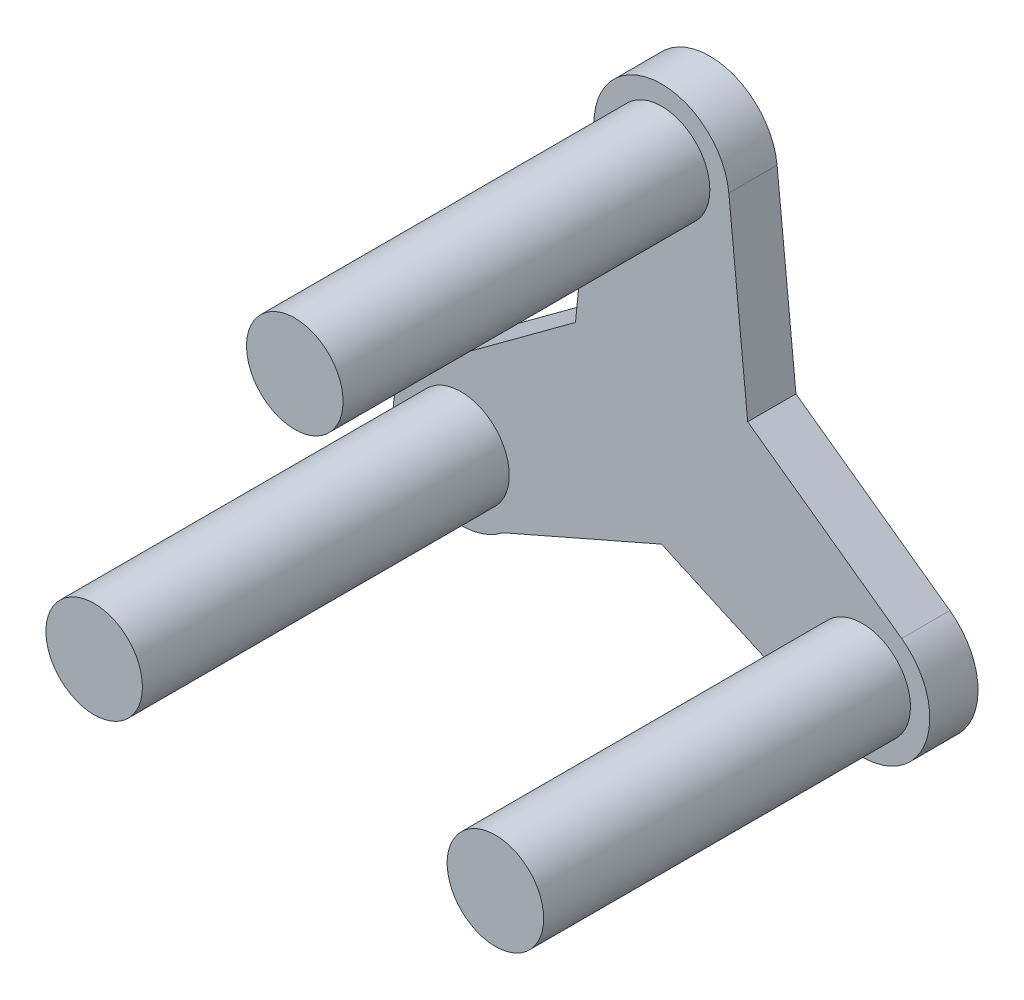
ISO-10303-21;
HEADER;
FILE_DESCRIPTION(('STEP AP214'),'2;1');
FILE_NAME('part.step','',(''),(''),'','','');
FILE_SCHEMA(('AUTOMOTIVE_DESIGN { 1 0 10303 214 1 1 1 1 }'));
ENDSEC;
DATA;
#1=APPLICATION_CONTEXT('core data for automotive mechanical design processes');
#2=APPLICATION_PROTOCOL_DEFINITION('international standard','automotive_design',2000,#1);
#3=PRODUCT_CONTEXT('',#1,'mechanical');
#4=PRODUCT('Part','Part','',(#3));
#5=PRODUCT_RELATED_PRODUCT_CATEGORY('part','',(#4));
#6=PRODUCT_DEFINITION_FORMATION('','',#4);
#7=PRODUCT_DEFINITION_CONTEXT('part definition',#1,'design');
#8=PRODUCT_DEFINITION('design','',#6,#7);
#9=PRODUCT_DEFINITION_SHAPE('','',#8);
#10=(LENGTH_UNIT() NAMED_UNIT(*) SI_UNIT(.MILLI.,.METRE.));
#11=(NAMED_UNIT(*) PLANE_ANGLE_UNIT() SI_UNIT($,.RADIAN.));
#12=(NAMED_UNIT(*) SI_UNIT($,.STERADIAN.) SOLID_ANGLE_UNIT());
#13=UNCERTAINTY_MEASURE_WITH_UNIT(LENGTH_MEASURE(1.E-05),#10,'distance_accuracy_value','');
#14=(GEOMETRIC_REPRESENTATION_CONTEXT(3) GLOBAL_UNCERTAINTY_ASSIGNED_CONTEXT((#13)) GLOBAL_UNIT_ASSIGNED_CONTEXT((#10,
#11,#12)) REPRESENTATION_CONTEXT('',''));
#15=CARTESIAN_POINT('',(0.,0.,0.));
#16=DIRECTION('',(0.,0.,1.));
#17=DIRECTION('',(1.,0.,0.));
#18=AXIS2_PLACEMENT_3D('',#15,#16,#17);
#19=CARTESIAN_POINT('',(1.89026991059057,-4.31806241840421,2.5));
#20=DIRECTION('',(0.401017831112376,-0.91607024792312,0.));
#21=DIRECTION('',(0.91607024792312,0.401017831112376,0.));
#22=AXIS2_PLACEMENT_3D('',#19,#20,#21);
#23=PLANE('',#22);
#24=DIRECTION('',(-0.91607024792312,-0.401017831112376,0.));
#25=VECTOR('',#24,1.);
#26=CARTESIAN_POINT('',(1.89026991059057,-4.31806241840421,0.));
#27=LINE('',#26,#25);
#28=CARTESIAN_POINT('',(-0.00549674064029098,-5.14795099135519,0.));
#29=VERTEX_POINT('',#28);
#30=CARTESIAN_POINT('',(-8.21897999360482,-8.74347573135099,0.));
#31=VERTEX_POINT('',#30);
#32=EDGE_CURVE('E143',#29,#31,#27,.T.);
#33=ORIENTED_EDGE('',*,*,#32,.F.);
#34=DIRECTION('',(0.,0.,-1.));
#35=VECTOR('',#34,1.);
#36=CARTESIAN_POINT('',(-0.00549674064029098,-5.14795099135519,2.5));
#37=LINE('',#36,#35);
#38=CARTESIAN_POINT('',(-0.00549674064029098,-5.14795099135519,2.5));
#39=VERTEX_POINT('',#38);
#40=EDGE_CURVE('E11',#39,#29,#37,.T.);
#41=ORIENTED_EDGE('',*,*,#40,.F.);
#42=DIRECTION('',(-0.91607024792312,-0.401017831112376,0.));
#43=VECTOR('',#42,1.);
#44=CARTESIAN_POINT('',(1.89026991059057,-4.31806241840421,2.5));
#45=LINE('',#44,#43);
#46=CARTESIAN_POINT('',(-8.21897999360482,-8.74347573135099,2.5));
#47=VERTEX_POINT('',#46);
#48=EDGE_CURVE('E164',#39,#47,#45,.T.);
#49=ORIENTED_EDGE('',*,*,#48,.T.);
#50=DIRECTION('',(0.,0.,-1.));
#51=VECTOR('',#50,1.);
#52=CARTESIAN_POINT('',(-8.21897999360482,-8.74347573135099,2.5));
#53=LINE('',#52,#51);
#54=EDGE_CURVE('E96',#47,#31,#53,.T.);
#55=ORIENTED_EDGE('',*,*,#54,.T.);
#56=EDGE_LOOP('',(#33,#41,#49,#55));
#57=FACE_BOUND('',#56,.T.);
#58=ADVANCED_FACE('F43',(#57),#23,.T.);
#59=CARTESIAN_POINT('',(-1.93090584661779,-4.27913418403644,2.5));
#60=DIRECTION('',(0.411302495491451,0.911498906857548,0.));
#61=DIRECTION('',(-0.911498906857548,0.411302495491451,0.));
#62=AXIS2_PLACEMENT_3D('',#59,#60,#61);
#63=PLANE('',#62);
#64=DIRECTION('',(0.911498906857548,-0.411302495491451,0.));
#65=VECTOR('',#64,1.);
#66=CARTESIAN_POINT('',(-1.93090584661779,-4.27913418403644,0.));
#67=LINE('',#66,#65);
#68=CARTESIAN_POINT('',(8.95274611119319,-9.19024617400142,0.));
#69=VERTEX_POINT('',#68);
#70=EDGE_CURVE('E146',#29,#69,#67,.T.);
#71=ORIENTED_EDGE('',*,*,#70,.T.);
#72=DIRECTION('',(0.,0.,-1.));
#73=VECTOR('',#72,1.);
#74=CARTESIAN_POINT('',(8.95274611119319,-9.19024617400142,2.5));
#75=LINE('',#74,#73);
#76=CARTESIAN_POINT('',(8.95274611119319,-9.19024617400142,2.5));
#77=VERTEX_POINT('',#76);
#78=EDGE_CURVE('E51',#77,#69,#75,.T.);
#79=ORIENTED_EDGE('',*,*,#78,.F.);
#80=DIRECTION('',(0.911498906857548,-0.411302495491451,0.));
#81=VECTOR('',#80,1.);
#82=CARTESIAN_POINT('',(-1.93090584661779,-4.27913418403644,2.5));
#83=LINE('',#82,#81);
#84=EDGE_CURVE('E196',#39,#77,#83,.T.);
#85=ORIENTED_EDGE('',*,*,#84,.F.);
#86=ORIENTED_EDGE('',*,*,#40,.T.);
#87=EDGE_LOOP('',(#71,#79,#85,#86));
#88=FACE_BOUND('',#87,.T.);
#89=ADVANCED_FACE('F252',(#88),#63,.F.);
#90=CARTESIAN_POINT('',(10.3923048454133,-6.,2.5));
#91=DIRECTION('',(0.,0.,-1.));
#92=DIRECTION('',(-1.,0.,0.));
#93=AXIS2_PLACEMENT_3D('',#90,#91,#92);
#94=CYLINDRICAL_SURFACE('',#93,3.5);
#95=CARTESIAN_POINT('',(10.3923048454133,-6.,0.));
#96=DIRECTION('',(0.,0.,1.));
#97=DIRECTION('',(1.,0.,0.));
#98=AXIS2_PLACEMENT_3D('',#95,#96,#97);
#99=CIRCLE('',#98,3.5);
#100=CARTESIAN_POINT('',(12.4353597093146,-3.15818247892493,0.));
#101=VERTEX_POINT('',#100);
#102=EDGE_CURVE('E149',#69,#101,#99,.T.);
#103=ORIENTED_EDGE('',*,*,#102,.T.);
#104=DIRECTION('',(0.,0.,-1.));
#105=VECTOR('',#104,1.);
#106=CARTESIAN_POINT('',(12.4353597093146,-3.15818247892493,2.5));
#107=LINE('',#106,#105);
#108=CARTESIAN_POINT('',(12.4353597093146,-3.15818247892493,2.5));
#109=VERTEX_POINT('',#108);
#110=EDGE_CURVE('E173',#109,#101,#107,.T.);
#111=ORIENTED_EDGE('',*,*,#110,.F.);
#112=CARTESIAN_POINT('',(10.3923048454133,-6.,2.5));
#113=DIRECTION('',(0.,0.,1.));
#114=DIRECTION('',(1.,0.,0.));
#115=AXIS2_PLACEMENT_3D('',#112,#113,#114);
#116=CIRCLE('',#115,3.5);
#117=EDGE_CURVE('E181',#77,#109,#116,.T.);
#118=ORIENTED_EDGE('',*,*,#117,.F.);
#119=ORIENTED_EDGE('',*,*,#78,.T.);
#120=EDGE_LOOP('',(#103,#111,#118,#119));
#121=FACE_BOUND('',#120,.T.);
#122=ADVANCED_FACE('F179',(#121),#94,.T.);
#123=CARTESIAN_POINT('',(2.74038598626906,3.81178060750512,2.5));
#124=DIRECTION('',(0.583729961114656,0.811947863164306,0.));
#125=DIRECTION('',(-0.811947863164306,0.583729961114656,0.));
#126=AXIS2_PLACEMENT_3D('',#123,#124,#125);
#127=PLANE('',#126);
#128=DIRECTION('',(0.811947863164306,-0.583729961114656,0.));
#129=VECTOR('',#128,1.);
#130=CARTESIAN_POINT('',(2.74038598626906,3.81178060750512,0.));
#131=LINE('',#130,#129);
#132=CARTESIAN_POINT('',(4.46040436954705,2.57521566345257,0.));
#133=VERTEX_POINT('',#132);
#134=EDGE_CURVE('E152',#133,#101,#131,.T.);
#135=ORIENTED_EDGE('',*,*,#134,.F.);
#136=DIRECTION('',(0.,0.,-1.));
#137=VECTOR('',#136,1.);
#138=CARTESIAN_POINT('',(4.46040436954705,2.57521566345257,2.5));
#139=LINE('',#138,#137);
#140=CARTESIAN_POINT('',(4.46040436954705,2.57521566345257,2.5));
#141=VERTEX_POINT('',#140);
#142=EDGE_CURVE('E171',#141,#133,#139,.T.);
#143=ORIENTED_EDGE('',*,*,#142,.F.);
#144=DIRECTION('',(0.811947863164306,-0.583729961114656,0.));
#145=VECTOR('',#144,1.);
#146=CARTESIAN_POINT('',(2.74038598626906,3.81178060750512,2.5));
#147=LINE('',#146,#145);
#148=EDGE_CURVE('E194',#141,#109,#147,.T.);
#149=ORIENTED_EDGE('',*,*,#148,.T.);
#150=ORIENTED_EDGE('',*,*,#110,.T.);
#151=EDGE_LOOP('',(#135,#143,#149,#150));
#152=FACE_BOUND('',#151,.T.);
#153=ADVANCED_FACE('F190',(#152),#127,.T.);
#154=CARTESIAN_POINT('',(4.67129183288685,0.467353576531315,2.5));
#155=DIRECTION('',(-0.995032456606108,-0.0995510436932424,0.));
#156=DIRECTION('',(0.0995510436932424,-0.995032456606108,0.));
#157=AXIS2_PLACEMENT_3D('',#154,#155,#156);
#158=PLANE('',#157);
#159=DIRECTION('',(-0.0995510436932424,0.995032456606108,0.));
#160=VECTOR('',#159,1.);
#161=CARTESIAN_POINT('',(4.67129183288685,0.467353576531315,0.));
#162=LINE('',#161,#160);
#163=CARTESIAN_POINT('',(3.48261359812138,12.3484286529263,0.));
#164=VERTEX_POINT('',#163);
#165=EDGE_CURVE('E155',#133,#164,#162,.T.);
#166=ORIENTED_EDGE('',*,*,#165,.T.);
#167=DIRECTION('',(0.,0.,-1.));
#168=VECTOR('',#167,1.);
#169=CARTESIAN_POINT('',(3.48261359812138,12.3484286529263,2.5));
#170=LINE('',#169,#168);
#171=CARTESIAN_POINT('',(3.48261359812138,12.3484286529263,2.5));
#172=VERTEX_POINT('',#171);
#173=EDGE_CURVE('E168',#172,#164,#170,.T.);
#174=ORIENTED_EDGE('',*,*,#173,.F.);
#175=DIRECTION('',(-0.0995510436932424,0.995032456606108,0.));
#176=VECTOR('',#175,1.);
#177=CARTESIAN_POINT('',(4.67129183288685,0.467353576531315,2.5));
#178=LINE('',#177,#176);
#179=EDGE_CURVE('E138',#141,#172,#178,.T.);
#180=ORIENTED_EDGE('',*,*,#179,.F.);
#181=ORIENTED_EDGE('',*,*,#142,.T.);
#182=EDGE_LOOP('',(#166,#174,#180,#181));
#183=FACE_BOUND('',#182,.T.);
#184=ADVANCED_FACE('F270',(#183),#158,.F.);
#185=CARTESIAN_POINT('',(0.,12.,2.5));
#186=DIRECTION('',(0.,0.,-1.));
#187=DIRECTION('',(-1.,0.,0.));
#188=AXIS2_PLACEMENT_3D('',#185,#186,#187);
#189=CYLINDRICAL_SURFACE('',#188,3.5);
#190=CARTESIAN_POINT('',(0.,12.,0.));
#191=DIRECTION('',(0.,0.,1.));
#192=DIRECTION('',(1.,0.,0.));
#193=AXIS2_PLACEMENT_3D('',#190,#191,#192);
#194=CIRCLE('',#193,3.5);
#195=CARTESIAN_POINT('',(-3.48261359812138,12.3484286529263,0.));
#196=VERTEX_POINT('',#195);
#197=EDGE_CURVE('E157',#164,#196,#194,.T.);
#198=ORIENTED_EDGE('',*,*,#197,.T.);
#199=DIRECTION('',(0.,0.,-1.));
#200=VECTOR('',#199,1.);
#201=CARTESIAN_POINT('',(-3.48261359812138,12.3484286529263,2.5));
#202=LINE('',#201,#200);
#203=CARTESIAN_POINT('',(-3.48261359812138,12.3484286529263,2.5));
#204=VERTEX_POINT('',#203);
#205=EDGE_CURVE('E127',#204,#196,#202,.T.);
#206=ORIENTED_EDGE('',*,*,#205,.F.);
#207=CARTESIAN_POINT('',(0.,12.,2.5));
#208=DIRECTION('',(0.,0.,1.));
#209=DIRECTION('',(1.,0.,0.));
#210=AXIS2_PLACEMENT_3D('',#207,#208,#209);
#211=CIRCLE('',#210,3.5);
#212=EDGE_CURVE('E135',#172,#204,#211,.T.);
#213=ORIENTED_EDGE('',*,*,#212,.F.);
#214=ORIENTED_EDGE('',*,*,#173,.T.);
#215=EDGE_LOOP('',(#198,#206,#213,#214));
#216=FACE_BOUND('',#215,.T.);
#217=ADVANCED_FACE('F267',(#216),#189,.T.);
#218=CARTESIAN_POINT('',(-4.67129183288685,0.467353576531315,2.5));
#219=DIRECTION('',(-0.995032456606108,0.0995510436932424,0.));
#220=DIRECTION('',(-0.0995510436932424,-0.995032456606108,0.));
#221=AXIS2_PLACEMENT_3D('',#218,#219,#220);
#222=PLANE('',#221);
#223=DIRECTION('',(0.0995510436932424,0.995032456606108,0.));
#224=VECTOR('',#223,1.);
#225=CARTESIAN_POINT('',(-4.67129183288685,0.467353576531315,0.));
#226=LINE('',#225,#224);
#227=CARTESIAN_POINT('',(-4.46100470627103,2.56921517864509,0.));
#228=VERTEX_POINT('',#227);
#229=EDGE_CURVE('E126',#228,#196,#226,.T.);
#230=ORIENTED_EDGE('',*,*,#229,.F.);
#231=DIRECTION('',(0.,0.,-1.));
#232=VECTOR('',#231,1.);
#233=CARTESIAN_POINT('',(-4.46100470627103,2.56921517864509,2.5));
#234=LINE('',#233,#232);
#235=CARTESIAN_POINT('',(-4.46100470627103,2.56921517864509,2.5));
#236=VERTEX_POINT('',#235);
#237=EDGE_CURVE('E120',#236,#228,#234,.T.);
#238=ORIENTED_EDGE('',*,*,#237,.F.);
#239=DIRECTION('',(0.0995510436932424,0.995032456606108,0.));
#240=VECTOR('',#239,1.);
#241=CARTESIAN_POINT('',(-4.67129183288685,0.467353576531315,2.5));
#242=LINE('',#241,#240);
#243=EDGE_CURVE('E124',#236,#204,#242,.T.);
#244=ORIENTED_EDGE('',*,*,#243,.T.);
#245=ORIENTED_EDGE('',*,*,#205,.T.);
#246=EDGE_LOOP('',(#230,#238,#244,#245));
#247=FACE_BOUND('',#246,.T.);
#248=ADVANCED_FACE('F122',(#247),#222,.T.);
#249=CARTESIAN_POINT('',(-2.79441679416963,3.79605297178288,2.5));
#250=DIRECTION('',(0.592831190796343,-0.805326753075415,0.));
#251=DIRECTION('',(0.805326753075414,0.592831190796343,0.));
#252=AXIS2_PLACEMENT_3D('',#249,#250,#251);
#253=PLANE('',#252);
#254=DIRECTION('',(-0.805326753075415,-0.592831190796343,0.));
#255=VECTOR('',#254,1.);
#256=CARTESIAN_POINT('',(-2.79441679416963,3.79605297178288,0.));
#257=LINE('',#256,#255);
#258=CARTESIAN_POINT('',(-11.6815620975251,-2.74610760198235,0.));
#259=VERTEX_POINT('',#258);
#260=EDGE_CURVE('E89',#228,#259,#257,.T.);
#261=ORIENTED_EDGE('',*,*,#260,.T.);
#262=DIRECTION('',(0.,0.,-1.));
#263=VECTOR('',#262,1.);
#264=CARTESIAN_POINT('',(-11.6815620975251,-2.74610760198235,2.5));
#265=LINE('',#264,#263);
#266=CARTESIAN_POINT('',(-11.6815620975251,-2.74610760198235,2.5));
#267=VERTEX_POINT('',#266);
#268=EDGE_CURVE('E128',#267,#259,#265,.T.);
#269=ORIENTED_EDGE('',*,*,#268,.F.);
#270=DIRECTION('',(-0.805326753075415,-0.592831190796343,0.));
#271=VECTOR('',#270,1.);
#272=CARTESIAN_POINT('',(-2.79441679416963,3.79605297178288,2.5));
#273=LINE('',#272,#271);
#274=EDGE_CURVE('E130',#236,#267,#273,.T.);
#275=ORIENTED_EDGE('',*,*,#274,.F.);
#276=ORIENTED_EDGE('',*,*,#237,.T.);
#277=EDGE_LOOP('',(#261,#269,#275,#276));
#278=FACE_BOUND('',#277,.T.);
#279=ADVANCED_FACE('F131',(#278),#253,.F.);
#280=CARTESIAN_POINT('',(-10.3923048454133,-6.00000000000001,2.5));
#281=DIRECTION('',(0.,0.,-1.));
#282=DIRECTION('',(-1.,0.,0.));
#283=AXIS2_PLACEMENT_3D('',#280,#281,#282);
#284=CYLINDRICAL_SURFACE('',#283,3.5);
#285=CARTESIAN_POINT('',(-10.3923048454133,-6.00000000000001,0.));
#286=DIRECTION('',(0.,0.,1.));
#287=DIRECTION('',(1.,0.,0.));
#288=AXIS2_PLACEMENT_3D('',#285,#286,#287);
#289=CIRCLE('',#288,3.5);
#290=EDGE_CURVE('E162',#259,#31,#289,.T.);
#291=ORIENTED_EDGE('',*,*,#290,.T.);
#292=ORIENTED_EDGE('',*,*,#54,.F.);
#293=CARTESIAN_POINT('',(-10.3923048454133,-6.00000000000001,2.5));
#294=DIRECTION('',(0.,0.,1.));
#295=DIRECTION('',(1.,0.,0.));
#296=AXIS2_PLACEMENT_3D('',#293,#294,#295);
#297=CIRCLE('',#296,3.5);
#298=EDGE_CURVE('E59',#267,#47,#297,.T.);
#299=ORIENTED_EDGE('',*,*,#298,.F.);
#300=ORIENTED_EDGE('',*,*,#268,.T.);
#301=EDGE_LOOP('',(#291,#292,#299,#300));
#302=FACE_BOUND('',#301,.T.);
#303=ADVANCED_FACE('F230',(#302),#284,.T.);
#304=CARTESIAN_POINT('',(0.,0.,2.5));
#305=DIRECTION('',(0.,0.,1.));
#306=DIRECTION('',(1.,0.,0.));
#307=AXIS2_PLACEMENT_3D('',#304,#305,#306);
#308=PLANE('',#307);
#309=CARTESIAN_POINT('',(0.,12.,2.5));
#310=DIRECTION('',(0.,0.,1.));
#311=DIRECTION('',(1.,0.,0.));
#312=AXIS2_PLACEMENT_3D('',#309,#310,#311);
#313=CIRCLE('',#312,2.5);
#314=CARTESIAN_POINT('',(2.5,12.,2.5));
#315=VERTEX_POINT('',#314);
#316=EDGE_CURVE('E213',#315,#315,#313,.T.);
#317=ORIENTED_EDGE('',*,*,#316,.F.);
#318=EDGE_LOOP('',(#317));
#319=FACE_BOUND('',#318,.T.);
#320=CARTESIAN_POINT('',(10.3923048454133,-6.,2.5));
#321=DIRECTION('',(0.,0.,1.));
#322=DIRECTION('',(1.,0.,0.));
#323=AXIS2_PLACEMENT_3D('',#320,#321,#322);
#324=CIRCLE('',#323,2.5);
#325=CARTESIAN_POINT('',(12.8923048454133,-6.,2.5));
#326=VERTEX_POINT('',#325);
#327=EDGE_CURVE('E210',#326,#326,#324,.T.);
#328=ORIENTED_EDGE('',*,*,#327,.F.);
#329=EDGE_LOOP('',(#328));
#330=FACE_BOUND('',#329,.T.);
#331=CARTESIAN_POINT('',(-10.3923048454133,-6.,2.5));
#332=DIRECTION('',(0.,0.,1.));
#333=DIRECTION('',(1.,0.,0.));
#334=AXIS2_PLACEMENT_3D('',#331,#332,#333);
#335=CIRCLE('',#334,2.5);
#336=CARTESIAN_POINT('',(-7.89230484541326,-6.,2.5));
#337=VERTEX_POINT('',#336);
#338=EDGE_CURVE('E204',#337,#337,#335,.T.);
#339=ORIENTED_EDGE('',*,*,#338,.F.);
#340=EDGE_LOOP('',(#339));
#341=FACE_BOUND('',#340,.T.);
#342=ORIENTED_EDGE('',*,*,#48,.F.);
#343=ORIENTED_EDGE('',*,*,#84,.T.);
#344=ORIENTED_EDGE('',*,*,#117,.T.);
#345=ORIENTED_EDGE('',*,*,#148,.F.);
#346=ORIENTED_EDGE('',*,*,#179,.T.);
#347=ORIENTED_EDGE('',*,*,#212,.T.);
#348=ORIENTED_EDGE('',*,*,#243,.F.);
#349=ORIENTED_EDGE('',*,*,#274,.T.);
#350=ORIENTED_EDGE('',*,*,#298,.T.);
#351=EDGE_LOOP('',(#342,#343,#344,#345,#346,#347,#348,#349,#350));
#352=FACE_BOUND('',#351,.T.);
#353=ADVANCED_FACE('F133',(#319,#330,#341,#352),#308,.T.);
#354=CARTESIAN_POINT('',(0.,0.,0.));
#355=DIRECTION('',(0.,0.,1.));
#356=DIRECTION('',(1.,0.,0.));
#357=AXIS2_PLACEMENT_3D('',#354,#355,#356);
#358=PLANE('',#357);
#359=ORIENTED_EDGE('',*,*,#32,.T.);
#360=ORIENTED_EDGE('',*,*,#290,.F.);
#361=ORIENTED_EDGE('',*,*,#260,.F.);
#362=ORIENTED_EDGE('',*,*,#229,.T.);
#363=ORIENTED_EDGE('',*,*,#197,.F.);
#364=ORIENTED_EDGE('',*,*,#165,.F.);
#365=ORIENTED_EDGE('',*,*,#134,.T.);
#366=ORIENTED_EDGE('',*,*,#102,.F.);
#367=ORIENTED_EDGE('',*,*,#70,.F.);
#368=EDGE_LOOP('',(#359,#360,#361,#362,#363,#364,#365,#366,#367));
#369=FACE_BOUND('',#368,.T.);
#370=ADVANCED_FACE('F185',(#369),#358,.F.);
#371=CARTESIAN_POINT('',(-10.3923048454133,-6.,21.5));
#372=DIRECTION('',(0.,0.,-1.));
#373=DIRECTION('',(-1.,0.,0.));
#374=AXIS2_PLACEMENT_3D('',#371,#372,#373);
#375=CYLINDRICAL_SURFACE('',#374,2.5);
#376=CARTESIAN_POINT('',(-10.3923048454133,-6.,21.5));
#377=DIRECTION('',(0.,0.,1.));
#378=DIRECTION('',(1.,0.,0.));
#379=AXIS2_PLACEMENT_3D('',#376,#377,#378);
#380=CIRCLE('',#379,2.5);
#381=CARTESIAN_POINT('',(-7.89230484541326,-6.,21.5));
#382=VERTEX_POINT('',#381);
#383=EDGE_CURVE('E201',#382,#382,#380,.T.);
#384=ORIENTED_EDGE('',*,*,#383,.F.);
#385=EDGE_LOOP('',(#384));
#386=FACE_BOUND('',#385,.T.);
#387=ORIENTED_EDGE('',*,*,#338,.T.);
#388=EDGE_LOOP('',(#387));
#389=FACE_BOUND('',#388,.T.);
#390=ADVANCED_FACE('F236',(#386,#389),#375,.T.);
#391=CARTESIAN_POINT('',(-10.3923048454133,-6.,21.5));
#392=DIRECTION('',(0.,0.,1.));
#393=DIRECTION('',(1.,0.,0.));
#394=AXIS2_PLACEMENT_3D('',#391,#392,#393);
#395=PLANE('',#394);
#396=ORIENTED_EDGE('',*,*,#383,.T.);
#397=EDGE_LOOP('',(#396));
#398=FACE_BOUND('',#397,.T.);
#399=ADVANCED_FACE('F238',(#398),#395,.T.);
#400=CARTESIAN_POINT('',(10.3923048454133,-6.,21.5));
#401=DIRECTION('',(0.,0.,-1.));
#402=DIRECTION('',(-1.,0.,0.));
#403=AXIS2_PLACEMENT_3D('',#400,#401,#402);
#404=CYLINDRICAL_SURFACE('',#403,2.5);
#405=CARTESIAN_POINT('',(10.3923048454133,-6.,21.5));
#406=DIRECTION('',(0.,0.,1.));
#407=DIRECTION('',(1.,0.,0.));
#408=AXIS2_PLACEMENT_3D('',#405,#406,#407);
#409=CIRCLE('',#408,2.5);
#410=CARTESIAN_POINT('',(12.8923048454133,-6.,21.5));
#411=VERTEX_POINT('',#410);
#412=EDGE_CURVE('E207',#411,#411,#409,.T.);
#413=ORIENTED_EDGE('',*,*,#412,.F.);
#414=EDGE_LOOP('',(#413));
#415=FACE_BOUND('',#414,.T.);
#416=ORIENTED_EDGE('',*,*,#327,.T.);
#417=EDGE_LOOP('',(#416));
#418=FACE_BOUND('',#417,.T.);
#419=ADVANCED_FACE('F244',(#415,#418),#404,.T.);
#420=CARTESIAN_POINT('',(10.3923048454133,-6.,21.5));
#421=DIRECTION('',(0.,0.,1.));
#422=DIRECTION('',(1.,0.,0.));
#423=AXIS2_PLACEMENT_3D('',#420,#421,#422);
#424=PLANE('',#423);
#425=ORIENTED_EDGE('',*,*,#412,.T.);
#426=EDGE_LOOP('',(#425));
#427=FACE_BOUND('',#426,.T.);
#428=ADVANCED_FACE('F224',(#427),#424,.T.);
#429=CARTESIAN_POINT('',(0.,12.,21.5));
#430=DIRECTION('',(0.,0.,-1.));
#431=DIRECTION('',(-1.,0.,0.));
#432=AXIS2_PLACEMENT_3D('',#429,#430,#431);
#433=CYLINDRICAL_SURFACE('',#432,2.5);
#434=CARTESIAN_POINT('',(0.,12.,21.5));
#435=DIRECTION('',(0.,0.,1.));
#436=DIRECTION('',(1.,0.,0.));
#437=AXIS2_PLACEMENT_3D('',#434,#435,#436);
#438=CIRCLE('',#437,2.5);
#439=CARTESIAN_POINT('',(2.5,12.,21.5));
#440=VERTEX_POINT('',#439);
#441=EDGE_CURVE('E147',#440,#440,#438,.T.);
#442=ORIENTED_EDGE('',*,*,#441,.F.);
#443=EDGE_LOOP('',(#442));
#444=FACE_BOUND('',#443,.T.);
#445=ORIENTED_EDGE('',*,*,#316,.T.);
#446=EDGE_LOOP('',(#445));
#447=FACE_BOUND('',#446,.T.);
#448=ADVANCED_FACE('F221',(#444,#447),#433,.T.);
#449=CARTESIAN_POINT('',(0.,12.,21.5));
#450=DIRECTION('',(0.,0.,1.));
#451=DIRECTION('',(1.,0.,0.));
#452=AXIS2_PLACEMENT_3D('',#449,#450,#451);
#453=PLANE('',#452);
#454=ORIENTED_EDGE('',*,*,#441,.T.);
#455=EDGE_LOOP('',(#454));
#456=FACE_BOUND('',#455,.T.);
#457=ADVANCED_FACE('F219',(#456),#453,.T.);
#458=CLOSED_SHELL('',(#58,#89,#122,#153,#184,#217,#248,#279,#303,#353,#370,#390,#399,#419,#428,
#448,#457));
#459=MANIFOLD_SOLID_BREP('B2',#458);
#460=ADVANCED_BREP_SHAPE_REPRESENTATION('',(#18,#459),#14);
#461=SHAPE_DEFINITION_REPRESENTATION(#9,#460);
ENDSEC;
END-ISO-10303-21;
